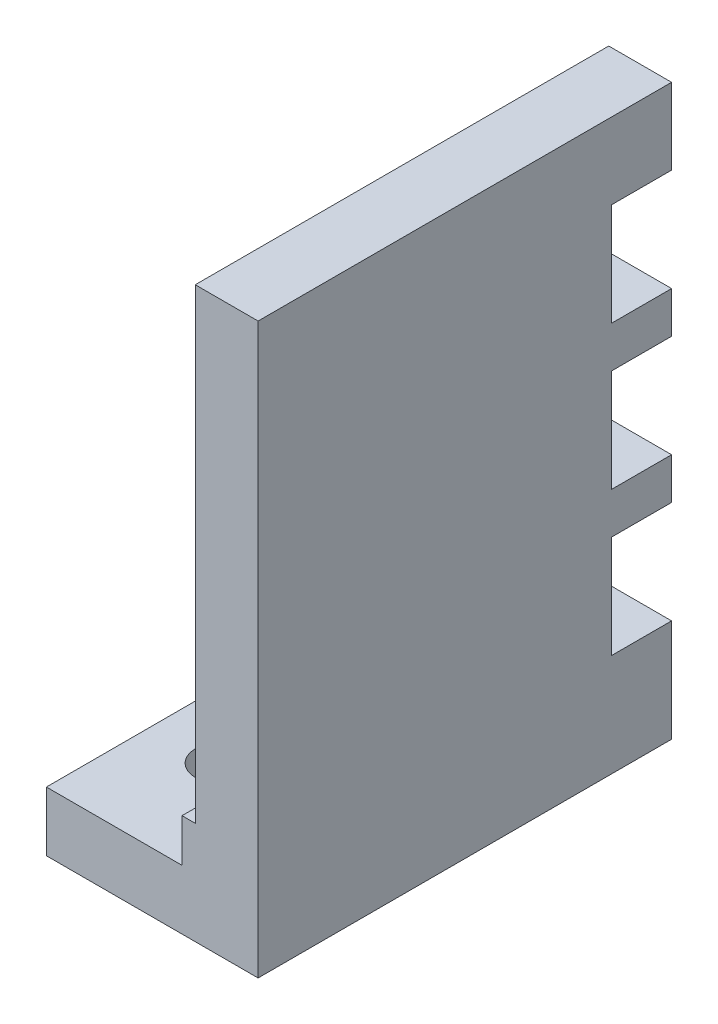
ISO-10303-21;
HEADER;
FILE_DESCRIPTION(('STEP AP214'),'2;1');
FILE_NAME('part.step','',(''),(''),'','','');
FILE_SCHEMA(('AUTOMOTIVE_DESIGN { 1 0 10303 214 1 1 1 1 }'));
ENDSEC;
DATA;
#1=APPLICATION_CONTEXT('core data for automotive mechanical design processes');
#2=APPLICATION_PROTOCOL_DEFINITION('international standard','automotive_design',2000,#1);
#3=PRODUCT_CONTEXT('',#1,'mechanical');
#4=PRODUCT('Part','Part','',(#3));
#5=PRODUCT_RELATED_PRODUCT_CATEGORY('part','',(#4));
#6=PRODUCT_DEFINITION_FORMATION('','',#4);
#7=PRODUCT_DEFINITION_CONTEXT('part definition',#1,'design');
#8=PRODUCT_DEFINITION('design','',#6,#7);
#9=PRODUCT_DEFINITION_SHAPE('','',#8);
#10=(LENGTH_UNIT() NAMED_UNIT(*) SI_UNIT(.MILLI.,.METRE.));
#11=(NAMED_UNIT(*) PLANE_ANGLE_UNIT() SI_UNIT($,.RADIAN.));
#12=(NAMED_UNIT(*) SI_UNIT($,.STERADIAN.) SOLID_ANGLE_UNIT());
#13=UNCERTAINTY_MEASURE_WITH_UNIT(LENGTH_MEASURE(1.E-05),#10,'distance_accuracy_value','');
#14=(GEOMETRIC_REPRESENTATION_CONTEXT(3) GLOBAL_UNCERTAINTY_ASSIGNED_CONTEXT((#13)) GLOBAL_UNIT_ASSIGNED_CONTEXT((#10,
#11,#12)) REPRESENTATION_CONTEXT('',''));
#15=CARTESIAN_POINT('',(0.,0.,0.));
#16=DIRECTION('',(0.,0.,1.));
#17=DIRECTION('',(1.,0.,0.));
#18=AXIS2_PLACEMENT_3D('',#15,#16,#17);
#19=CARTESIAN_POINT('',(-4.826,7.874,31.75));
#20=DIRECTION('',(1.,0.,0.));
#21=DIRECTION('',(0.,0.,-1.));
#22=AXIS2_PLACEMENT_3D('',#19,#20,#21);
#23=PLANE('',#22);
#24=DIRECTION('',(0.,-1.,0.));
#25=VECTOR('',#24,1.);
#26=CARTESIAN_POINT('',(-4.826,15.748,4.6228));
#27=LINE('',#26,#25);
#28=CARTESIAN_POINT('',(-4.826,15.748,4.6228));
#29=VERTEX_POINT('',#28);
#30=CARTESIAN_POINT('',(-4.826,7.874,4.6228));
#31=VERTEX_POINT('',#30);
#32=EDGE_CURVE('E178',#29,#31,#27,.T.);
#33=ORIENTED_EDGE('',*,*,#32,.T.);
#34=DIRECTION('',(0.,0.,-1.));
#35=VECTOR('',#34,1.);
#36=CARTESIAN_POINT('',(-4.826,7.874,31.75));
#37=LINE('',#36,#35);
#38=CARTESIAN_POINT('',(-4.826,7.874,31.75));
#39=VERTEX_POINT('',#38);
#40=EDGE_CURVE('E43',#39,#31,#37,.T.);
#41=ORIENTED_EDGE('',*,*,#40,.F.);
#42=DIRECTION('',(0.,-1.,0.));
#43=VECTOR('',#42,1.);
#44=CARTESIAN_POINT('',(-4.826,7.874,31.75));
#45=LINE('',#44,#43);
#46=CARTESIAN_POINT('',(-4.826,43.688,31.75));
#47=VERTEX_POINT('',#46);
#48=EDGE_CURVE('E243',#47,#39,#45,.T.);
#49=ORIENTED_EDGE('',*,*,#48,.F.);
#50=DIRECTION('',(0.,0.,-1.));
#51=VECTOR('',#50,1.);
#52=CARTESIAN_POINT('',(-4.826,43.688,31.75));
#53=LINE('',#52,#51);
#54=CARTESIAN_POINT('',(-4.826,43.688,0.));
#55=VERTEX_POINT('',#54);
#56=EDGE_CURVE('E11',#47,#55,#53,.T.);
#57=ORIENTED_EDGE('',*,*,#56,.T.);
#58=DIRECTION('',(0.,-1.,0.));
#59=VECTOR('',#58,1.);
#60=CARTESIAN_POINT('',(-4.826,7.874,0.));
#61=LINE('',#60,#59);
#62=CARTESIAN_POINT('',(-4.826,37.846,0.));
#63=VERTEX_POINT('',#62);
#64=EDGE_CURVE('E193',#55,#63,#61,.T.);
#65=ORIENTED_EDGE('',*,*,#64,.T.);
#66=DIRECTION('',(0.,0.,1.));
#67=VECTOR('',#66,1.);
#68=CARTESIAN_POINT('',(-4.826,37.846,4.6228));
#69=LINE('',#68,#67);
#70=CARTESIAN_POINT('',(-4.826,37.846,4.6228));
#71=VERTEX_POINT('',#70);
#72=EDGE_CURVE('E282',#63,#71,#69,.T.);
#73=ORIENTED_EDGE('',*,*,#72,.T.);
#74=DIRECTION('',(0.,-1.,0.));
#75=VECTOR('',#74,1.);
#76=CARTESIAN_POINT('',(-4.826,37.846,4.6228));
#77=LINE('',#76,#75);
#78=CARTESIAN_POINT('',(-4.826,29.972,4.6228));
#79=VERTEX_POINT('',#78);
#80=EDGE_CURVE('E279',#71,#79,#77,.T.);
#81=ORIENTED_EDGE('',*,*,#80,.T.);
#82=DIRECTION('',(0.,0.,-1.));
#83=VECTOR('',#82,1.);
#84=CARTESIAN_POINT('',(-4.826,29.972,4.6228));
#85=LINE('',#84,#83);
#86=CARTESIAN_POINT('',(-4.826,29.972,0.));
#87=VERTEX_POINT('',#86);
#88=EDGE_CURVE('E301',#79,#87,#85,.T.);
#89=ORIENTED_EDGE('',*,*,#88,.T.);
#90=CARTESIAN_POINT('',(-4.826,26.797,0.));
#91=VERTEX_POINT('',#90);
#92=EDGE_CURVE('E190',#87,#91,#61,.T.);
#93=ORIENTED_EDGE('',*,*,#92,.T.);
#94=DIRECTION('',(0.,0.,1.));
#95=VECTOR('',#94,1.);
#96=CARTESIAN_POINT('',(-4.826,26.797,4.6228));
#97=LINE('',#96,#95);
#98=CARTESIAN_POINT('',(-4.826,26.797,4.6228));
#99=VERTEX_POINT('',#98);
#100=EDGE_CURVE('E260',#91,#99,#97,.T.);
#101=ORIENTED_EDGE('',*,*,#100,.T.);
#102=DIRECTION('',(0.,-1.,0.));
#103=VECTOR('',#102,1.);
#104=CARTESIAN_POINT('',(-4.826,26.797,4.6228));
#105=LINE('',#104,#103);
#106=CARTESIAN_POINT('',(-4.826,18.923,4.6228));
#107=VERTEX_POINT('',#106);
#108=EDGE_CURVE('E258',#99,#107,#105,.T.);
#109=ORIENTED_EDGE('',*,*,#108,.T.);
#110=DIRECTION('',(0.,0.,-1.));
#111=VECTOR('',#110,1.);
#112=CARTESIAN_POINT('',(-4.826,18.923,4.6228));
#113=LINE('',#112,#111);
#114=CARTESIAN_POINT('',(-4.826,18.923,0.));
#115=VERTEX_POINT('',#114);
#116=EDGE_CURVE('E189',#107,#115,#113,.T.);
#117=ORIENTED_EDGE('',*,*,#116,.T.);
#118=CARTESIAN_POINT('',(-4.826,15.748,0.));
#119=VERTEX_POINT('',#118);
#120=EDGE_CURVE('E184',#115,#119,#61,.T.);
#121=ORIENTED_EDGE('',*,*,#120,.T.);
#122=DIRECTION('',(0.,0.,1.));
#123=VECTOR('',#122,1.);
#124=CARTESIAN_POINT('',(-4.826,15.748,4.6228));
#125=LINE('',#124,#123);
#126=EDGE_CURVE('E169',#119,#29,#125,.T.);
#127=ORIENTED_EDGE('',*,*,#126,.T.);
#128=EDGE_LOOP('',(#33,#41,#49,#57,#65,#73,#81,#89,#93,#101,#109,#117,#121,#127));
#129=FACE_BOUND('',#128,.T.);
#130=ADVANCED_FACE('F35',(#129),#23,.F.);
#131=CARTESIAN_POINT('',(0.,43.688,31.75));
#132=DIRECTION('',(-1.,0.,0.));
#133=DIRECTION('',(0.,-1.,0.));
#134=AXIS2_PLACEMENT_3D('',#131,#132,#133);
#135=PLANE('',#134);
#136=DIRECTION('',(0.,0.,-1.));
#137=VECTOR('',#136,1.);
#138=CARTESIAN_POINT('',(0.,15.748,4.6228));
#139=LINE('',#138,#137);
#140=CARTESIAN_POINT('',(0.,15.748,4.6228));
#141=VERTEX_POINT('',#140);
#142=CARTESIAN_POINT('',(0.,15.748,0.));
#143=VERTEX_POINT('',#142);
#144=EDGE_CURVE('E249',#141,#143,#139,.T.);
#145=ORIENTED_EDGE('',*,*,#144,.T.);
#146=DIRECTION('',(0.,1.,0.));
#147=VECTOR('',#146,1.);
#148=CARTESIAN_POINT('',(0.,43.688,0.));
#149=LINE('',#148,#147);
#150=CARTESIAN_POINT('',(0.,18.923,0.));
#151=VERTEX_POINT('',#150);
#152=EDGE_CURVE('E50',#143,#151,#149,.T.);
#153=ORIENTED_EDGE('',*,*,#152,.T.);
#154=DIRECTION('',(0.,0.,1.));
#155=VECTOR('',#154,1.);
#156=CARTESIAN_POINT('',(0.,18.923,4.6228));
#157=LINE('',#156,#155);
#158=CARTESIAN_POINT('',(0.,18.923,4.6228));
#159=VERTEX_POINT('',#158);
#160=EDGE_CURVE('E268',#151,#159,#157,.T.);
#161=ORIENTED_EDGE('',*,*,#160,.T.);
#162=DIRECTION('',(0.,1.,0.));
#163=VECTOR('',#162,1.);
#164=CARTESIAN_POINT('',(0.,26.797,4.6228));
#165=LINE('',#164,#163);
#166=CARTESIAN_POINT('',(0.,26.797,4.6228));
#167=VERTEX_POINT('',#166);
#168=EDGE_CURVE('E263',#159,#167,#165,.T.);
#169=ORIENTED_EDGE('',*,*,#168,.T.);
#170=DIRECTION('',(0.,0.,-1.));
#171=VECTOR('',#170,1.);
#172=CARTESIAN_POINT('',(0.,26.797,4.6228));
#173=LINE('',#172,#171);
#174=CARTESIAN_POINT('',(0.,26.797,0.));
#175=VERTEX_POINT('',#174);
#176=EDGE_CURVE('E266',#167,#175,#173,.T.);
#177=ORIENTED_EDGE('',*,*,#176,.T.);
#178=CARTESIAN_POINT('',(0.,29.972,0.));
#179=VERTEX_POINT('',#178);
#180=EDGE_CURVE('E57',#175,#179,#149,.T.);
#181=ORIENTED_EDGE('',*,*,#180,.T.);
#182=DIRECTION('',(0.,0.,1.));
#183=VECTOR('',#182,1.);
#184=CARTESIAN_POINT('',(0.,29.972,4.6228));
#185=LINE('',#184,#183);
#186=CARTESIAN_POINT('',(0.,29.972,4.6228));
#187=VERTEX_POINT('',#186);
#188=EDGE_CURVE('E290',#179,#187,#185,.T.);
#189=ORIENTED_EDGE('',*,*,#188,.T.);
#190=DIRECTION('',(0.,1.,0.));
#191=VECTOR('',#190,1.);
#192=CARTESIAN_POINT('',(0.,37.846,4.6228));
#193=LINE('',#192,#191);
#194=CARTESIAN_POINT('',(0.,37.846,4.6228));
#195=VERTEX_POINT('',#194);
#196=EDGE_CURVE('E284',#187,#195,#193,.T.);
#197=ORIENTED_EDGE('',*,*,#196,.T.);
#198=DIRECTION('',(0.,0.,-1.));
#199=VECTOR('',#198,1.);
#200=CARTESIAN_POINT('',(0.,37.846,4.6228));
#201=LINE('',#200,#199);
#202=CARTESIAN_POINT('',(0.,37.846,0.));
#203=VERTEX_POINT('',#202);
#204=EDGE_CURVE('E287',#195,#203,#201,.T.);
#205=ORIENTED_EDGE('',*,*,#204,.T.);
#206=CARTESIAN_POINT('',(0.,43.688,0.));
#207=VERTEX_POINT('',#206);
#208=EDGE_CURVE('E215',#203,#207,#149,.T.);
#209=ORIENTED_EDGE('',*,*,#208,.T.);
#210=DIRECTION('',(0.,0.,-1.));
#211=VECTOR('',#210,1.);
#212=CARTESIAN_POINT('',(0.,43.688,31.75));
#213=LINE('',#212,#211);
#214=CARTESIAN_POINT('',(0.,43.688,31.75));
#215=VERTEX_POINT('',#214);
#216=EDGE_CURVE('E220',#215,#207,#213,.T.);
#217=ORIENTED_EDGE('',*,*,#216,.F.);
#218=DIRECTION('',(0.,1.,0.));
#219=VECTOR('',#218,1.);
#220=CARTESIAN_POINT('',(0.,43.688,31.75));
#221=LINE('',#220,#219);
#222=CARTESIAN_POINT('',(0.,0.,31.75));
#223=VERTEX_POINT('',#222);
#224=EDGE_CURVE('E224',#223,#215,#221,.T.);
#225=ORIENTED_EDGE('',*,*,#224,.F.);
#226=DIRECTION('',(0.,0.,-1.));
#227=VECTOR('',#226,1.);
#228=CARTESIAN_POINT('',(0.,0.,31.75));
#229=LINE('',#228,#227);
#230=CARTESIAN_POINT('',(0.,0.,0.));
#231=VERTEX_POINT('',#230);
#232=EDGE_CURVE('E223',#223,#231,#229,.T.);
#233=ORIENTED_EDGE('',*,*,#232,.T.);
#234=CARTESIAN_POINT('',(0.,7.874,0.));
#235=VERTEX_POINT('',#234);
#236=EDGE_CURVE('E216',#231,#235,#149,.T.);
#237=ORIENTED_EDGE('',*,*,#236,.T.);
#238=DIRECTION('',(0.,0.,1.));
#239=VECTOR('',#238,1.);
#240=CARTESIAN_POINT('',(0.,7.874,4.6228));
#241=LINE('',#240,#239);
#242=CARTESIAN_POINT('',(0.,7.874,4.6228));
#243=VERTEX_POINT('',#242);
#244=EDGE_CURVE('E253',#235,#243,#241,.T.);
#245=ORIENTED_EDGE('',*,*,#244,.T.);
#246=DIRECTION('',(0.,1.,0.));
#247=VECTOR('',#246,1.);
#248=CARTESIAN_POINT('',(0.,15.748,4.6228));
#249=LINE('',#248,#247);
#250=EDGE_CURVE('E246',#243,#141,#249,.T.);
#251=ORIENTED_EDGE('',*,*,#250,.T.);
#252=EDGE_LOOP('',(#145,#153,#161,#169,#177,#181,#189,#197,#205,#209,#217,#225,#233,#237,#245,#251));
#253=FACE_BOUND('',#252,.T.);
#254=ADVANCED_FACE('F334',(#253),#135,.F.);
#255=CARTESIAN_POINT('',(0.,0.,0.));
#256=DIRECTION('',(0.,0.,-1.));
#257=DIRECTION('',(-1.,0.,0.));
#258=AXIS2_PLACEMENT_3D('',#255,#256,#257);
#259=PLANE('',#258);
#260=ORIENTED_EDGE('',*,*,#152,.F.);
#261=DIRECTION('',(1.,0.,0.));
#262=VECTOR('',#261,1.);
#263=CARTESIAN_POINT('',(-16.257,15.748,0.));
#264=LINE('',#263,#262);
#265=EDGE_CURVE('E173',#119,#143,#264,.T.);
#266=ORIENTED_EDGE('',*,*,#265,.F.);
#267=ORIENTED_EDGE('',*,*,#120,.F.);
#268=DIRECTION('',(1.,0.,0.));
#269=VECTOR('',#268,1.);
#270=CARTESIAN_POINT('',(-16.257,18.923,0.));
#271=LINE('',#270,#269);
#272=EDGE_CURVE('E272',#115,#151,#271,.T.);
#273=ORIENTED_EDGE('',*,*,#272,.T.);
#274=EDGE_LOOP('',(#260,#266,#267,#273));
#275=FACE_BOUND('',#274,.T.);
#276=ADVANCED_FACE('F182',(#275),#259,.T.);
#277=DIRECTION('',(-1.,0.,0.));
#278=VECTOR('',#277,1.);
#279=CARTESIAN_POINT('',(-5.842,7.874,0.));
#280=LINE('',#279,#278);
#281=CARTESIAN_POINT('',(-5.842,7.874,0.));
#282=VERTEX_POINT('',#281);
#283=EDGE_CURVE('E200',#235,#282,#280,.T.);
#284=ORIENTED_EDGE('',*,*,#283,.F.);
#285=ORIENTED_EDGE('',*,*,#236,.F.);
#286=DIRECTION('',(1.,0.,0.));
#287=VECTOR('',#286,1.);
#288=CARTESIAN_POINT('',(0.,0.,0.));
#289=LINE('',#288,#287);
#290=CARTESIAN_POINT('',(-16.256,0.,0.));
#291=VERTEX_POINT('',#290);
#292=EDGE_CURVE('E213',#291,#231,#289,.T.);
#293=ORIENTED_EDGE('',*,*,#292,.F.);
#294=DIRECTION('',(0.,-1.,0.));
#295=VECTOR('',#294,1.);
#296=CARTESIAN_POINT('',(-16.256,0.,0.));
#297=LINE('',#296,#295);
#298=CARTESIAN_POINT('',(-16.256,4.572,0.));
#299=VERTEX_POINT('',#298);
#300=EDGE_CURVE('E211',#299,#291,#297,.T.);
#301=ORIENTED_EDGE('',*,*,#300,.F.);
#302=DIRECTION('',(-1.,0.,0.));
#303=VECTOR('',#302,1.);
#304=CARTESIAN_POINT('',(-16.256,4.572,0.));
#305=LINE('',#304,#303);
#306=CARTESIAN_POINT('',(-5.84199999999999,4.572,0.));
#307=VERTEX_POINT('',#306);
#308=EDGE_CURVE('E207',#307,#299,#305,.T.);
#309=ORIENTED_EDGE('',*,*,#308,.F.);
#310=DIRECTION('',(0.,-1.,0.));
#311=VECTOR('',#310,1.);
#312=CARTESIAN_POINT('',(-5.84199999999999,4.572,0.));
#313=LINE('',#312,#311);
#314=EDGE_CURVE('E202',#282,#307,#313,.T.);
#315=ORIENTED_EDGE('',*,*,#314,.F.);
#316=EDGE_LOOP('',(#284,#285,#293,#301,#309,#315));
#317=FACE_BOUND('',#316,.T.);
#318=ADVANCED_FACE('F490',(#317),#259,.T.);
#319=ORIENTED_EDGE('',*,*,#180,.F.);
#320=DIRECTION('',(1.,0.,0.));
#321=VECTOR('',#320,1.);
#322=CARTESIAN_POINT('',(-16.257,26.797,0.));
#323=LINE('',#322,#321);
#324=EDGE_CURVE('E274',#91,#175,#323,.T.);
#325=ORIENTED_EDGE('',*,*,#324,.F.);
#326=ORIENTED_EDGE('',*,*,#92,.F.);
#327=DIRECTION('',(1.,0.,0.));
#328=VECTOR('',#327,1.);
#329=CARTESIAN_POINT('',(-16.257,29.972,0.));
#330=LINE('',#329,#328);
#331=EDGE_CURVE('E294',#87,#179,#330,.T.);
#332=ORIENTED_EDGE('',*,*,#331,.T.);
#333=EDGE_LOOP('',(#319,#325,#326,#332));
#334=FACE_BOUND('',#333,.T.);
#335=ADVANCED_FACE('F353',(#334),#259,.T.);
#336=ORIENTED_EDGE('',*,*,#208,.F.);
#337=DIRECTION('',(1.,0.,0.));
#338=VECTOR('',#337,1.);
#339=CARTESIAN_POINT('',(-16.257,37.846,0.));
#340=LINE('',#339,#338);
#341=EDGE_CURVE('E297',#63,#203,#340,.T.);
#342=ORIENTED_EDGE('',*,*,#341,.F.);
#343=ORIENTED_EDGE('',*,*,#64,.F.);
#344=DIRECTION('',(-1.,0.,0.));
#345=VECTOR('',#344,1.);
#346=CARTESIAN_POINT('',(-4.826,43.688,0.));
#347=LINE('',#346,#345);
#348=EDGE_CURVE('E191',#207,#55,#347,.T.);
#349=ORIENTED_EDGE('',*,*,#348,.F.);
#350=EDGE_LOOP('',(#336,#342,#343,#349));
#351=FACE_BOUND('',#350,.T.);
#352=ADVANCED_FACE('F339',(#351),#259,.T.);
#353=CARTESIAN_POINT('',(-4.826,43.688,31.75));
#354=DIRECTION('',(0.,-1.,0.));
#355=DIRECTION('',(0.,0.,-1.));
#356=AXIS2_PLACEMENT_3D('',#353,#354,#355);
#357=PLANE('',#356);
#358=ORIENTED_EDGE('',*,*,#348,.T.);
#359=ORIENTED_EDGE('',*,*,#56,.F.);
#360=DIRECTION('',(-1.,0.,0.));
#361=VECTOR('',#360,1.);
#362=CARTESIAN_POINT('',(-4.826,43.688,31.75));
#363=LINE('',#362,#361);
#364=EDGE_CURVE('E219',#215,#47,#363,.T.);
#365=ORIENTED_EDGE('',*,*,#364,.F.);
#366=ORIENTED_EDGE('',*,*,#216,.T.);
#367=EDGE_LOOP('',(#358,#359,#365,#366));
#368=FACE_BOUND('',#367,.T.);
#369=ADVANCED_FACE('F37',(#368),#357,.F.);
#370=CARTESIAN_POINT('',(-5.842,7.874,31.75));
#371=DIRECTION('',(0.,-1.,0.));
#372=DIRECTION('',(0.,0.,-1.));
#373=AXIS2_PLACEMENT_3D('',#370,#371,#372);
#374=PLANE('',#373);
#375=ORIENTED_EDGE('',*,*,#283,.T.);
#376=DIRECTION('',(0.,0.,-1.));
#377=VECTOR('',#376,1.);
#378=CARTESIAN_POINT('',(-5.842,7.874,31.75));
#379=LINE('',#378,#377);
#380=CARTESIAN_POINT('',(-5.842,7.874,31.75));
#381=VERTEX_POINT('',#380);
#382=EDGE_CURVE('E236',#381,#282,#379,.T.);
#383=ORIENTED_EDGE('',*,*,#382,.F.);
#384=DIRECTION('',(-1.,0.,0.));
#385=VECTOR('',#384,1.);
#386=CARTESIAN_POINT('',(-5.842,7.874,31.75));
#387=LINE('',#386,#385);
#388=EDGE_CURVE('E242',#39,#381,#387,.T.);
#389=ORIENTED_EDGE('',*,*,#388,.F.);
#390=ORIENTED_EDGE('',*,*,#40,.T.);
#391=DIRECTION('',(1.,0.,0.));
#392=VECTOR('',#391,1.);
#393=CARTESIAN_POINT('',(-16.257,7.874,4.6228));
#394=LINE('',#393,#392);
#395=EDGE_CURVE('E185',#31,#243,#394,.T.);
#396=ORIENTED_EDGE('',*,*,#395,.T.);
#397=ORIENTED_EDGE('',*,*,#244,.F.);
#398=EDGE_LOOP('',(#375,#383,#389,#390,#396,#397));
#399=FACE_BOUND('',#398,.T.);
#400=ADVANCED_FACE('F240',(#399),#374,.F.);
#401=CARTESIAN_POINT('',(-5.84199999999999,4.572,31.75));
#402=DIRECTION('',(1.,0.,0.));
#403=DIRECTION('',(0.,1.,0.));
#404=AXIS2_PLACEMENT_3D('',#401,#402,#403);
#405=PLANE('',#404);
#406=ORIENTED_EDGE('',*,*,#314,.T.);
#407=DIRECTION('',(0.,0.,-1.));
#408=VECTOR('',#407,1.);
#409=CARTESIAN_POINT('',(-5.84199999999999,4.572,31.75));
#410=LINE('',#409,#408);
#411=CARTESIAN_POINT('',(-5.84199999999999,4.572,31.75));
#412=VERTEX_POINT('',#411);
#413=EDGE_CURVE('E233',#412,#307,#410,.T.);
#414=ORIENTED_EDGE('',*,*,#413,.F.);
#415=DIRECTION('',(0.,-1.,0.));
#416=VECTOR('',#415,1.);
#417=CARTESIAN_POINT('',(-5.84199999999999,4.572,31.75));
#418=LINE('',#417,#416);
#419=EDGE_CURVE('E318',#381,#412,#418,.T.);
#420=ORIENTED_EDGE('',*,*,#419,.F.);
#421=ORIENTED_EDGE('',*,*,#382,.T.);
#422=EDGE_LOOP('',(#406,#414,#420,#421));
#423=FACE_BOUND('',#422,.T.);
#424=ADVANCED_FACE('F381',(#423),#405,.F.);
#425=CARTESIAN_POINT('',(-16.256,4.572,31.75));
#426=DIRECTION('',(0.,-1.,0.));
#427=DIRECTION('',(1.,0.,0.));
#428=AXIS2_PLACEMENT_3D('',#425,#426,#427);
#429=PLANE('',#428);
#430=CARTESIAN_POINT('',(-11.176,4.572,23.495));
#431=DIRECTION('',(0.,-1.,0.));
#432=DIRECTION('',(1.,0.,0.));
#433=AXIS2_PLACEMENT_3D('',#430,#431,#432);
#434=CIRCLE('',#433,1.89864999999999);
#435=CARTESIAN_POINT('',(-9.27735000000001,4.572,23.495));
#436=VERTEX_POINT('',#435);
#437=EDGE_CURVE('E307',#436,#436,#434,.T.);
#438=ORIENTED_EDGE('',*,*,#437,.T.);
#439=EDGE_LOOP('',(#438));
#440=FACE_BOUND('',#439,.T.);
#441=CARTESIAN_POINT('',(-11.176,4.572,7.62));
#442=DIRECTION('',(0.,-1.,0.));
#443=DIRECTION('',(1.,0.,0.));
#444=AXIS2_PLACEMENT_3D('',#441,#442,#443);
#445=CIRCLE('',#444,1.89864999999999);
#446=CARTESIAN_POINT('',(-9.27735000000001,4.572,7.62));
#447=VERTEX_POINT('',#446);
#448=EDGE_CURVE('E196',#447,#447,#445,.T.);
#449=ORIENTED_EDGE('',*,*,#448,.T.);
#450=EDGE_LOOP('',(#449));
#451=FACE_BOUND('',#450,.T.);
#452=ORIENTED_EDGE('',*,*,#308,.T.);
#453=DIRECTION('',(0.,0.,-1.));
#454=VECTOR('',#453,1.);
#455=CARTESIAN_POINT('',(-16.256,4.572,31.75));
#456=LINE('',#455,#454);
#457=CARTESIAN_POINT('',(-16.256,4.572,31.75));
#458=VERTEX_POINT('',#457);
#459=EDGE_CURVE('E230',#458,#299,#456,.T.);
#460=ORIENTED_EDGE('',*,*,#459,.F.);
#461=DIRECTION('',(-1.,0.,0.));
#462=VECTOR('',#461,1.);
#463=CARTESIAN_POINT('',(-16.256,4.572,31.75));
#464=LINE('',#463,#462);
#465=EDGE_CURVE('E320',#412,#458,#464,.T.);
#466=ORIENTED_EDGE('',*,*,#465,.F.);
#467=ORIENTED_EDGE('',*,*,#413,.T.);
#468=EDGE_LOOP('',(#452,#460,#466,#467));
#469=FACE_BOUND('',#468,.T.);
#470=ADVANCED_FACE('F384',(#440,#451,#469),#429,.F.);
#471=CARTESIAN_POINT('',(-16.256,0.,31.75));
#472=DIRECTION('',(1.,0.,0.));
#473=DIRECTION('',(0.,0.,-1.));
#474=AXIS2_PLACEMENT_3D('',#471,#472,#473);
#475=PLANE('',#474);
#476=ORIENTED_EDGE('',*,*,#300,.T.);
#477=DIRECTION('',(0.,0.,-1.));
#478=VECTOR('',#477,1.);
#479=CARTESIAN_POINT('',(-16.256,0.,31.75));
#480=LINE('',#479,#478);
#481=CARTESIAN_POINT('',(-16.256,0.,31.75));
#482=VERTEX_POINT('',#481);
#483=EDGE_CURVE('E227',#482,#291,#480,.T.);
#484=ORIENTED_EDGE('',*,*,#483,.F.);
#485=DIRECTION('',(0.,-1.,0.));
#486=VECTOR('',#485,1.);
#487=CARTESIAN_POINT('',(-16.256,0.,31.75));
#488=LINE('',#487,#486);
#489=EDGE_CURVE('E322',#458,#482,#488,.T.);
#490=ORIENTED_EDGE('',*,*,#489,.F.);
#491=ORIENTED_EDGE('',*,*,#459,.T.);
#492=EDGE_LOOP('',(#476,#484,#490,#491));
#493=FACE_BOUND('',#492,.T.);
#494=ADVANCED_FACE('F388',(#493),#475,.F.);
#495=CARTESIAN_POINT('',(0.,0.,31.75));
#496=DIRECTION('',(0.,1.,0.));
#497=DIRECTION('',(-1.,0.,0.));
#498=AXIS2_PLACEMENT_3D('',#495,#496,#497);
#499=PLANE('',#498);
#500=CARTESIAN_POINT('',(-11.176,0.,23.495));
#501=DIRECTION('',(0.,-1.,0.));
#502=DIRECTION('',(0.,0.,-1.));
#503=AXIS2_PLACEMENT_3D('',#500,#501,#502);
#504=CIRCLE('',#503,1.89864999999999);
#505=CARTESIAN_POINT('',(-11.176,0.,21.59635));
#506=VERTEX_POINT('',#505);
#507=EDGE_CURVE('E304',#506,#506,#504,.T.);
#508=ORIENTED_EDGE('',*,*,#507,.F.);
#509=EDGE_LOOP('',(#508));
#510=FACE_BOUND('',#509,.T.);
#511=CARTESIAN_POINT('',(-11.176,0.,7.62));
#512=DIRECTION('',(0.,-1.,0.));
#513=DIRECTION('',(0.,0.,-1.));
#514=AXIS2_PLACEMENT_3D('',#511,#512,#513);
#515=CIRCLE('',#514,1.89864999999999);
#516=CARTESIAN_POINT('',(-11.176,0.,5.72135000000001));
#517=VERTEX_POINT('',#516);
#518=EDGE_CURVE('E310',#517,#517,#515,.T.);
#519=ORIENTED_EDGE('',*,*,#518,.F.);
#520=EDGE_LOOP('',(#519));
#521=FACE_BOUND('',#520,.T.);
#522=ORIENTED_EDGE('',*,*,#292,.T.);
#523=ORIENTED_EDGE('',*,*,#232,.F.);
#524=DIRECTION('',(1.,0.,0.));
#525=VECTOR('',#524,1.);
#526=CARTESIAN_POINT('',(0.,0.,31.75));
#527=LINE('',#526,#525);
#528=EDGE_CURVE('E324',#482,#223,#527,.T.);
#529=ORIENTED_EDGE('',*,*,#528,.F.);
#530=ORIENTED_EDGE('',*,*,#483,.T.);
#531=EDGE_LOOP('',(#522,#523,#529,#530));
#532=FACE_BOUND('',#531,.T.);
#533=ADVANCED_FACE('F392',(#510,#521,#532),#499,.F.);
#534=CARTESIAN_POINT('',(0.,0.,31.75));
#535=DIRECTION('',(0.,0.,-1.));
#536=DIRECTION('',(-1.,0.,0.));
#537=AXIS2_PLACEMENT_3D('',#534,#535,#536);
#538=PLANE('',#537);
#539=ORIENTED_EDGE('',*,*,#364,.T.);
#540=ORIENTED_EDGE('',*,*,#48,.T.);
#541=ORIENTED_EDGE('',*,*,#388,.T.);
#542=ORIENTED_EDGE('',*,*,#419,.T.);
#543=ORIENTED_EDGE('',*,*,#465,.T.);
#544=ORIENTED_EDGE('',*,*,#489,.T.);
#545=ORIENTED_EDGE('',*,*,#528,.T.);
#546=ORIENTED_EDGE('',*,*,#224,.T.);
#547=EDGE_LOOP('',(#539,#540,#541,#542,#543,#544,#545,#546));
#548=FACE_BOUND('',#547,.T.);
#549=ADVANCED_FACE('F329',(#548),#538,.F.);
#550=CARTESIAN_POINT('',(-11.176,0.,7.62));
#551=DIRECTION('',(0.,-1.,0.));
#552=DIRECTION('',(0.,0.,-1.));
#553=AXIS2_PLACEMENT_3D('',#550,#551,#552);
#554=CYLINDRICAL_SURFACE('',#553,1.89864999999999);
#555=ORIENTED_EDGE('',*,*,#518,.T.);
#556=EDGE_LOOP('',(#555));
#557=FACE_BOUND('',#556,.T.);
#558=ORIENTED_EDGE('',*,*,#448,.F.);
#559=EDGE_LOOP('',(#558));
#560=FACE_BOUND('',#559,.T.);
#561=ADVANCED_FACE('F401',(#557,#560),#554,.F.);
#562=CARTESIAN_POINT('',(-11.176,0.,23.495));
#563=DIRECTION('',(0.,-1.,0.));
#564=DIRECTION('',(0.,0.,-1.));
#565=AXIS2_PLACEMENT_3D('',#562,#563,#564);
#566=CYLINDRICAL_SURFACE('',#565,1.89864999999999);
#567=ORIENTED_EDGE('',*,*,#507,.T.);
#568=EDGE_LOOP('',(#567));
#569=FACE_BOUND('',#568,.T.);
#570=ORIENTED_EDGE('',*,*,#437,.F.);
#571=EDGE_LOOP('',(#570));
#572=FACE_BOUND('',#571,.T.);
#573=ADVANCED_FACE('F404',(#569,#572),#566,.F.);
#574=CARTESIAN_POINT('',(-16.257,37.846,4.6228));
#575=DIRECTION('',(0.,0.,-1.));
#576=DIRECTION('',(0.,1.,0.));
#577=AXIS2_PLACEMENT_3D('',#574,#575,#576);
#578=PLANE('',#577);
#579=DIRECTION('',(1.,0.,0.));
#580=VECTOR('',#579,1.);
#581=CARTESIAN_POINT('',(-16.257,37.846,4.6228));
#582=LINE('',#581,#580);
#583=EDGE_CURVE('E299',#71,#195,#582,.T.);
#584=ORIENTED_EDGE('',*,*,#583,.T.);
#585=ORIENTED_EDGE('',*,*,#196,.F.);
#586=DIRECTION('',(1.,0.,0.));
#587=VECTOR('',#586,1.);
#588=CARTESIAN_POINT('',(-16.257,29.972,4.6228));
#589=LINE('',#588,#587);
#590=EDGE_CURVE('E292',#79,#187,#589,.T.);
#591=ORIENTED_EDGE('',*,*,#590,.F.);
#592=ORIENTED_EDGE('',*,*,#80,.F.);
#593=EDGE_LOOP('',(#584,#585,#591,#592));
#594=FACE_BOUND('',#593,.T.);
#595=ADVANCED_FACE('F348',(#594),#578,.T.);
#596=CARTESIAN_POINT('',(-16.257,37.846,4.6228));
#597=DIRECTION('',(0.,-1.,0.));
#598=DIRECTION('',(1.,0.,0.));
#599=AXIS2_PLACEMENT_3D('',#596,#597,#598);
#600=PLANE('',#599);
#601=ORIENTED_EDGE('',*,*,#341,.T.);
#602=ORIENTED_EDGE('',*,*,#204,.F.);
#603=ORIENTED_EDGE('',*,*,#583,.F.);
#604=ORIENTED_EDGE('',*,*,#72,.F.);
#605=EDGE_LOOP('',(#601,#602,#603,#604));
#606=FACE_BOUND('',#605,.T.);
#607=ADVANCED_FACE('F343',(#606),#600,.T.);
#608=CARTESIAN_POINT('',(-16.257,29.972,4.6228));
#609=DIRECTION('',(0.,1.,0.));
#610=DIRECTION('',(-1.,0.,0.));
#611=AXIS2_PLACEMENT_3D('',#608,#609,#610);
#612=PLANE('',#611);
#613=ORIENTED_EDGE('',*,*,#590,.T.);
#614=ORIENTED_EDGE('',*,*,#188,.F.);
#615=ORIENTED_EDGE('',*,*,#331,.F.);
#616=ORIENTED_EDGE('',*,*,#88,.F.);
#617=EDGE_LOOP('',(#613,#614,#615,#616));
#618=FACE_BOUND('',#617,.T.);
#619=ADVANCED_FACE('F413',(#618),#612,.T.);
#620=CARTESIAN_POINT('',(-16.257,26.797,4.6228));
#621=DIRECTION('',(0.,0.,-1.));
#622=DIRECTION('',(0.,1.,0.));
#623=AXIS2_PLACEMENT_3D('',#620,#621,#622);
#624=PLANE('',#623);
#625=DIRECTION('',(1.,0.,0.));
#626=VECTOR('',#625,1.);
#627=CARTESIAN_POINT('',(-16.257,26.797,4.6228));
#628=LINE('',#627,#626);
#629=EDGE_CURVE('E276',#99,#167,#628,.T.);
#630=ORIENTED_EDGE('',*,*,#629,.T.);
#631=ORIENTED_EDGE('',*,*,#168,.F.);
#632=DIRECTION('',(1.,0.,0.));
#633=VECTOR('',#632,1.);
#634=CARTESIAN_POINT('',(-16.257,18.923,4.6228));
#635=LINE('',#634,#633);
#636=EDGE_CURVE('E270',#107,#159,#635,.T.);
#637=ORIENTED_EDGE('',*,*,#636,.F.);
#638=ORIENTED_EDGE('',*,*,#108,.F.);
#639=EDGE_LOOP('',(#630,#631,#637,#638));
#640=FACE_BOUND('',#639,.T.);
#641=ADVANCED_FACE('F361',(#640),#624,.T.);
#642=CARTESIAN_POINT('',(-16.257,26.797,4.6228));
#643=DIRECTION('',(0.,-1.,0.));
#644=DIRECTION('',(1.,0.,0.));
#645=AXIS2_PLACEMENT_3D('',#642,#643,#644);
#646=PLANE('',#645);
#647=ORIENTED_EDGE('',*,*,#324,.T.);
#648=ORIENTED_EDGE('',*,*,#176,.F.);
#649=ORIENTED_EDGE('',*,*,#629,.F.);
#650=ORIENTED_EDGE('',*,*,#100,.F.);
#651=EDGE_LOOP('',(#647,#648,#649,#650));
#652=FACE_BOUND('',#651,.T.);
#653=ADVANCED_FACE('F356',(#652),#646,.T.);
#654=CARTESIAN_POINT('',(-16.257,18.923,4.6228));
#655=DIRECTION('',(0.,1.,0.));
#656=DIRECTION('',(-1.,0.,0.));
#657=AXIS2_PLACEMENT_3D('',#654,#655,#656);
#658=PLANE('',#657);
#659=ORIENTED_EDGE('',*,*,#636,.T.);
#660=ORIENTED_EDGE('',*,*,#160,.F.);
#661=ORIENTED_EDGE('',*,*,#272,.F.);
#662=ORIENTED_EDGE('',*,*,#116,.F.);
#663=EDGE_LOOP('',(#659,#660,#661,#662));
#664=FACE_BOUND('',#663,.T.);
#665=ADVANCED_FACE('F363',(#664),#658,.T.);
#666=CARTESIAN_POINT('',(-16.257,15.748,4.6228));
#667=DIRECTION('',(0.,0.,-1.));
#668=DIRECTION('',(0.,1.,0.));
#669=AXIS2_PLACEMENT_3D('',#666,#667,#668);
#670=PLANE('',#669);
#671=DIRECTION('',(1.,0.,0.));
#672=VECTOR('',#671,1.);
#673=CARTESIAN_POINT('',(-16.257,15.748,4.6228));
#674=LINE('',#673,#672);
#675=EDGE_CURVE('E174',#29,#141,#674,.T.);
#676=ORIENTED_EDGE('',*,*,#675,.T.);
#677=ORIENTED_EDGE('',*,*,#250,.F.);
#678=ORIENTED_EDGE('',*,*,#395,.F.);
#679=ORIENTED_EDGE('',*,*,#32,.F.);
#680=EDGE_LOOP('',(#676,#677,#678,#679));
#681=FACE_BOUND('',#680,.T.);
#682=ADVANCED_FACE('F365',(#681),#670,.T.);
#683=CARTESIAN_POINT('',(-16.257,15.748,4.6228));
#684=DIRECTION('',(0.,-1.,0.));
#685=DIRECTION('',(1.,0.,0.));
#686=AXIS2_PLACEMENT_3D('',#683,#684,#685);
#687=PLANE('',#686);
#688=ORIENTED_EDGE('',*,*,#265,.T.);
#689=ORIENTED_EDGE('',*,*,#144,.F.);
#690=ORIENTED_EDGE('',*,*,#675,.F.);
#691=ORIENTED_EDGE('',*,*,#126,.F.);
#692=EDGE_LOOP('',(#688,#689,#690,#691));
#693=FACE_BOUND('',#692,.T.);
#694=ADVANCED_FACE('F171',(#693),#687,.T.);
#695=CLOSED_SHELL('',(#130,#254,#276,#318,#335,#352,#369,#400,#424,#470,#494,#533,#549,#561,
#573,#595,#607,#619,#641,#653,#665,#682,#694));
#696=MANIFOLD_SOLID_BREP('B2',#695);
#697=ADVANCED_BREP_SHAPE_REPRESENTATION('',(#18,#696),#14);
#698=SHAPE_DEFINITION_REPRESENTATION(#9,#697);
ENDSEC;
END-ISO-10303-21;
